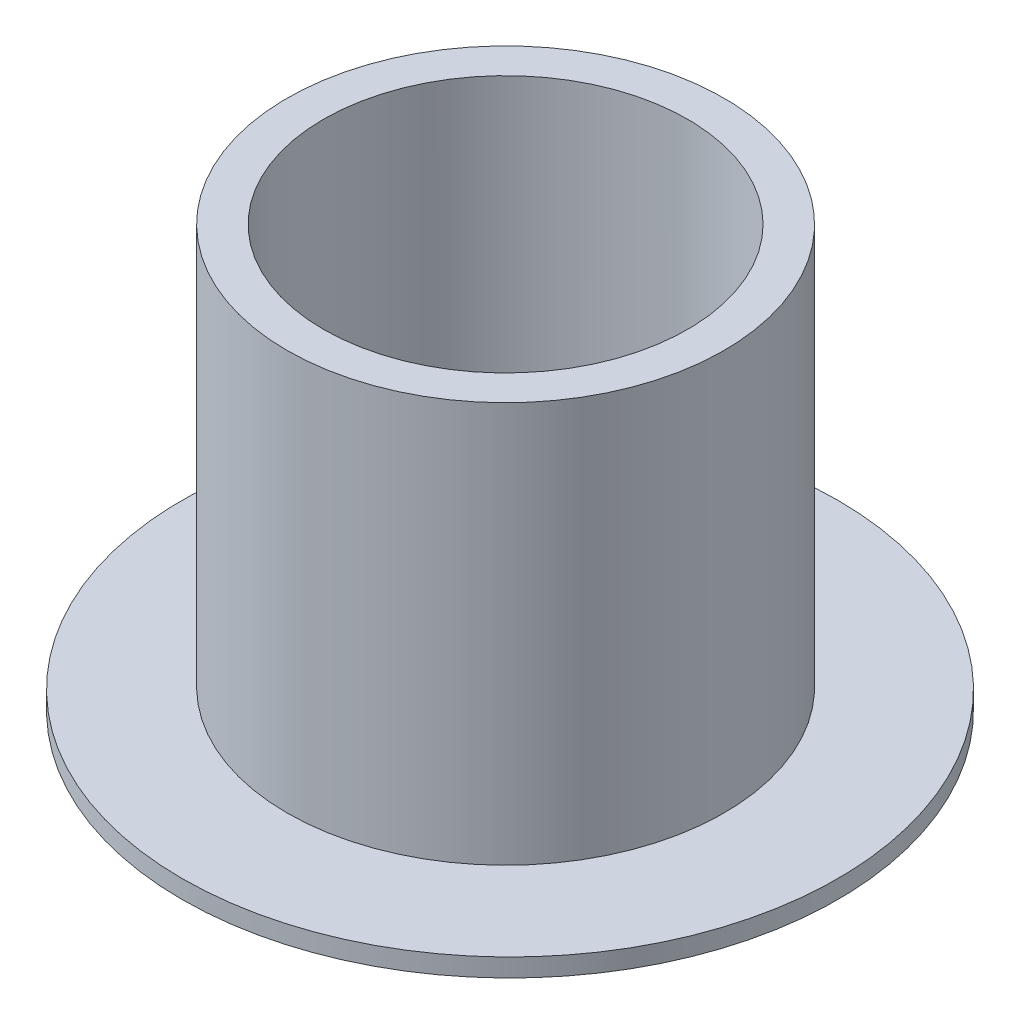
ISO-10303-21;
HEADER;
FILE_DESCRIPTION(('STEP AP214'),'2;1');
FILE_NAME('part.step','',(''),(''),'','','');
FILE_SCHEMA(('AUTOMOTIVE_DESIGN { 1 0 10303 214 1 1 1 1 }'));
ENDSEC;
DATA;
#1=APPLICATION_CONTEXT('core data for automotive mechanical design processes');
#2=APPLICATION_PROTOCOL_DEFINITION('international standard','automotive_design',2000,#1);
#3=PRODUCT_CONTEXT('',#1,'mechanical');
#4=PRODUCT('Part','Part','',(#3));
#5=PRODUCT_RELATED_PRODUCT_CATEGORY('part','',(#4));
#6=PRODUCT_DEFINITION_FORMATION('','',#4);
#7=PRODUCT_DEFINITION_CONTEXT('part definition',#1,'design');
#8=PRODUCT_DEFINITION('design','',#6,#7);
#9=PRODUCT_DEFINITION_SHAPE('','',#8);
#10=(LENGTH_UNIT() NAMED_UNIT(*) SI_UNIT(.MILLI.,.METRE.));
#11=(NAMED_UNIT(*) PLANE_ANGLE_UNIT() SI_UNIT($,.RADIAN.));
#12=(NAMED_UNIT(*) SI_UNIT($,.STERADIAN.) SOLID_ANGLE_UNIT());
#13=UNCERTAINTY_MEASURE_WITH_UNIT(LENGTH_MEASURE(1.E-05),#10,'distance_accuracy_value','');
#14=(GEOMETRIC_REPRESENTATION_CONTEXT(3) GLOBAL_UNCERTAINTY_ASSIGNED_CONTEXT((#13)) GLOBAL_UNIT_ASSIGNED_CONTEXT((#10,
#11,#12)) REPRESENTATION_CONTEXT('',''));
#15=CARTESIAN_POINT('',(0.,0.,0.));
#16=DIRECTION('',(0.,0.,1.));
#17=DIRECTION('',(1.,0.,0.));
#18=AXIS2_PLACEMENT_3D('',#15,#16,#17);
#19=CARTESIAN_POINT('',(0.,0.,0.));
#20=DIRECTION('',(0.,1.,0.));
#21=DIRECTION('',(0.,0.,1.));
#22=AXIS2_PLACEMENT_3D('',#19,#20,#21);
#23=PLANE('',#22);
#24=CARTESIAN_POINT('',(0.,0.,0.));
#25=DIRECTION('',(0.,1.,0.));
#26=DIRECTION('',(0.,0.,1.));
#27=AXIS2_PLACEMENT_3D('',#24,#25,#26);
#28=CIRCLE('',#27,12.7);
#29=CARTESIAN_POINT('',(-12.7,0.,0.));
#30=VERTEX_POINT('',#29);
#31=EDGE_CURVE('E61',#30,#30,#28,.T.);
#32=ORIENTED_EDGE('',*,*,#31,.T.);
#33=CARTESIAN_POINT('',(0.307730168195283,0.,0.));
#34=DIRECTION('',(0.,-1.,0.));
#35=DIRECTION('',(0.,0.,-1.));
#36=AXIS2_PLACEMENT_3D('',#33,#34,#35);
#37=CIRCLE('',#36,13.0077301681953);
#38=EDGE_CURVE('E44',#30,#30,#37,.T.);
#39=ORIENTED_EDGE('',*,*,#38,.T.);
#40=EDGE_LOOP('',(#32,#39));
#41=FACE_BOUND('',#40,.T.);
#42=ADVANCED_FACE('F32',(#41),#23,.F.);
#43=CARTESIAN_POINT('',(0.,27.94,0.));
#44=DIRECTION('',(0.,1.,0.));
#45=DIRECTION('',(0.,0.,1.));
#46=AXIS2_PLACEMENT_3D('',#43,#44,#45);
#47=PLANE('',#46);
#48=CARTESIAN_POINT('',(0.,27.94,0.));
#49=DIRECTION('',(0.,1.,0.));
#50=DIRECTION('',(0.,0.,1.));
#51=AXIS2_PLACEMENT_3D('',#48,#49,#50);
#52=CIRCLE('',#51,15.24);
#53=CARTESIAN_POINT('',(0.,27.94,15.24));
#54=VERTEX_POINT('',#53);
#55=EDGE_CURVE('E11',#54,#54,#52,.T.);
#56=ORIENTED_EDGE('',*,*,#55,.T.);
#57=EDGE_LOOP('',(#56));
#58=FACE_BOUND('',#57,.T.);
#59=CARTESIAN_POINT('',(0.,27.94,0.));
#60=DIRECTION('',(0.,1.,0.));
#61=DIRECTION('',(0.,0.,1.));
#62=AXIS2_PLACEMENT_3D('',#59,#60,#61);
#63=CIRCLE('',#62,12.7);
#64=CARTESIAN_POINT('',(0.,27.94,12.7));
#65=VERTEX_POINT('',#64);
#66=EDGE_CURVE('E40',#65,#65,#63,.T.);
#67=ORIENTED_EDGE('',*,*,#66,.F.);
#68=EDGE_LOOP('',(#67));
#69=FACE_BOUND('',#68,.T.);
#70=ADVANCED_FACE('F86',(#58,#69),#47,.T.);
#71=CARTESIAN_POINT('',(0.,27.94,0.));
#72=DIRECTION('',(0.,-1.,0.));
#73=DIRECTION('',(0.,0.,-1.));
#74=AXIS2_PLACEMENT_3D('',#71,#72,#73);
#75=CYLINDRICAL_SURFACE('',#74,15.24);
#76=ORIENTED_EDGE('',*,*,#55,.F.);
#77=EDGE_LOOP('',(#76));
#78=FACE_BOUND('',#77,.T.);
#79=CARTESIAN_POINT('',(0.,0.,0.));
#80=DIRECTION('',(0.,1.,0.));
#81=DIRECTION('',(0.,0.,1.));
#82=AXIS2_PLACEMENT_3D('',#79,#80,#81);
#83=CIRCLE('',#82,15.24);
#84=CARTESIAN_POINT('',(0.,0.,15.24));
#85=VERTEX_POINT('',#84);
#86=EDGE_CURVE('E36',#85,#85,#83,.T.);
#87=ORIENTED_EDGE('',*,*,#86,.T.);
#88=EDGE_LOOP('',(#87));
#89=FACE_BOUND('',#88,.T.);
#90=ADVANCED_FACE('F34',(#78,#89),#75,.T.);
#91=CARTESIAN_POINT('',(0.,27.94,0.));
#92=DIRECTION('',(0.,-1.,0.));
#93=DIRECTION('',(0.,0.,-1.));
#94=AXIS2_PLACEMENT_3D('',#91,#92,#93);
#95=CYLINDRICAL_SURFACE('',#94,12.7);
#96=ORIENTED_EDGE('',*,*,#66,.T.);
#97=EDGE_LOOP('',(#96));
#98=FACE_BOUND('',#97,.T.);
#99=ORIENTED_EDGE('',*,*,#31,.F.);
#100=EDGE_LOOP('',(#99));
#101=FACE_BOUND('',#100,.T.);
#102=ADVANCED_FACE('F92',(#98,#101),#95,.F.);
#103=CARTESIAN_POINT('',(0.307730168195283,-1.27,0.));
#104=DIRECTION('',(0.,-1.,0.));
#105=DIRECTION('',(0.,0.,-1.));
#106=AXIS2_PLACEMENT_3D('',#103,#104,#105);
#107=PLANE('',#106);
#108=CARTESIAN_POINT('',(0.307730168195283,-1.27,0.));
#109=DIRECTION('',(0.,-1.,0.));
#110=DIRECTION('',(0.,0.,-1.));
#111=AXIS2_PLACEMENT_3D('',#108,#109,#110);
#112=CIRCLE('',#111,22.86);
#113=CARTESIAN_POINT('',(0.307730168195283,-1.27,-22.86));
#114=VERTEX_POINT('',#113);
#115=EDGE_CURVE('E54',#114,#114,#112,.T.);
#116=ORIENTED_EDGE('',*,*,#115,.T.);
#117=EDGE_LOOP('',(#116));
#118=FACE_BOUND('',#117,.T.);
#119=CARTESIAN_POINT('',(0.307730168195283,-1.27,0.));
#120=DIRECTION('',(0.,-1.,0.));
#121=DIRECTION('',(0.,0.,-1.));
#122=AXIS2_PLACEMENT_3D('',#119,#120,#121);
#123=CIRCLE('',#122,13.0077301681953);
#124=CARTESIAN_POINT('',(0.307730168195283,-1.27,-13.0077301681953));
#125=VERTEX_POINT('',#124);
#126=EDGE_CURVE('E48',#125,#125,#123,.T.);
#127=ORIENTED_EDGE('',*,*,#126,.F.);
#128=EDGE_LOOP('',(#127));
#129=FACE_BOUND('',#128,.T.);
#130=ADVANCED_FACE('F71',(#118,#129),#107,.T.);
#131=CARTESIAN_POINT('',(0.307730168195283,0.,0.));
#132=DIRECTION('',(0.,-1.,0.));
#133=DIRECTION('',(0.,0.,-1.));
#134=AXIS2_PLACEMENT_3D('',#131,#132,#133);
#135=PLANE('',#134);
#136=ORIENTED_EDGE('',*,*,#86,.F.);
#137=EDGE_LOOP('',(#136));
#138=FACE_BOUND('',#137,.T.);
#139=CARTESIAN_POINT('',(0.307730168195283,0.,0.));
#140=DIRECTION('',(0.,-1.,0.));
#141=DIRECTION('',(0.,0.,-1.));
#142=AXIS2_PLACEMENT_3D('',#139,#140,#141);
#143=CIRCLE('',#142,22.86);
#144=CARTESIAN_POINT('',(0.307730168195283,0.,-22.86));
#145=VERTEX_POINT('',#144);
#146=EDGE_CURVE('E51',#145,#145,#143,.T.);
#147=ORIENTED_EDGE('',*,*,#146,.F.);
#148=EDGE_LOOP('',(#147));
#149=FACE_BOUND('',#148,.T.);
#150=ADVANCED_FACE('F67',(#138,#149),#135,.F.);
#151=CARTESIAN_POINT('',(0.307730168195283,-1.27,0.));
#152=DIRECTION('',(0.,1.,0.));
#153=DIRECTION('',(0.,0.,1.));
#154=AXIS2_PLACEMENT_3D('',#151,#152,#153);
#155=CYLINDRICAL_SURFACE('',#154,22.86);
#156=ORIENTED_EDGE('',*,*,#115,.F.);
#157=EDGE_LOOP('',(#156));
#158=FACE_BOUND('',#157,.T.);
#159=ORIENTED_EDGE('',*,*,#146,.T.);
#160=EDGE_LOOP('',(#159));
#161=FACE_BOUND('',#160,.T.);
#162=ADVANCED_FACE('F70',(#158,#161),#155,.T.);
#163=CARTESIAN_POINT('',(0.307730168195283,-1.27,0.));
#164=DIRECTION('',(0.,1.,0.));
#165=DIRECTION('',(0.,0.,1.));
#166=AXIS2_PLACEMENT_3D('',#163,#164,#165);
#167=CYLINDRICAL_SURFACE('',#166,13.0077301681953);
#168=ORIENTED_EDGE('',*,*,#126,.T.);
#169=EDGE_LOOP('',(#168));
#170=FACE_BOUND('',#169,.T.);
#171=ORIENTED_EDGE('',*,*,#38,.F.);
#172=EDGE_LOOP('',(#171));
#173=FACE_BOUND('',#172,.T.);
#174=ADVANCED_FACE('F45',(#170,#173),#167,.F.);
#175=CLOSED_SHELL('',(#42,#70,#90,#102,#130,#150,#162,#174));
#176=MANIFOLD_SOLID_BREP('B2',#175);
#177=ADVANCED_BREP_SHAPE_REPRESENTATION('',(#18,#176),#14);
#178=SHAPE_DEFINITION_REPRESENTATION(#9,#177);
ENDSEC;
END-ISO-10303-21;
